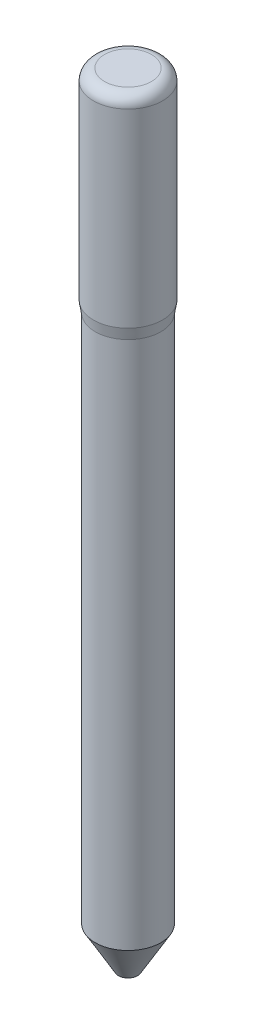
from build123d import *


with BuildPart() as part:
    # Sketch1 → Revolve1 (revolve)
    with BuildSketch(Plane.XY, mode=Mode.PRIVATE) as revolve1_sk:
        with BuildLine():
            Line((0, 0), (0.215384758, 0))
            Line((0.215384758, 0), (0.735, 0.9))
            Line((0.735, 0.9), (0.735, 12.75))
            Line((0.735, 12.75), (0.775, 13))
            Line((0.775, 13), (0.775, 17.25))
            ThreePointArc((0.775, 17.25), (0.701776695, 17.426776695), (0.525, 17.5))
            Line((0.525, 17.5), (0, 17.5))
            Line((0, 17.5), (0, 0))
        make_face()
    revolve(revolve1_sk.sketch.rotate(Axis((0, 0, 0), (0, 1, 0)), 90), axis=Axis((0, 0, 0), (0, 1, 0)))


solid = part.part
